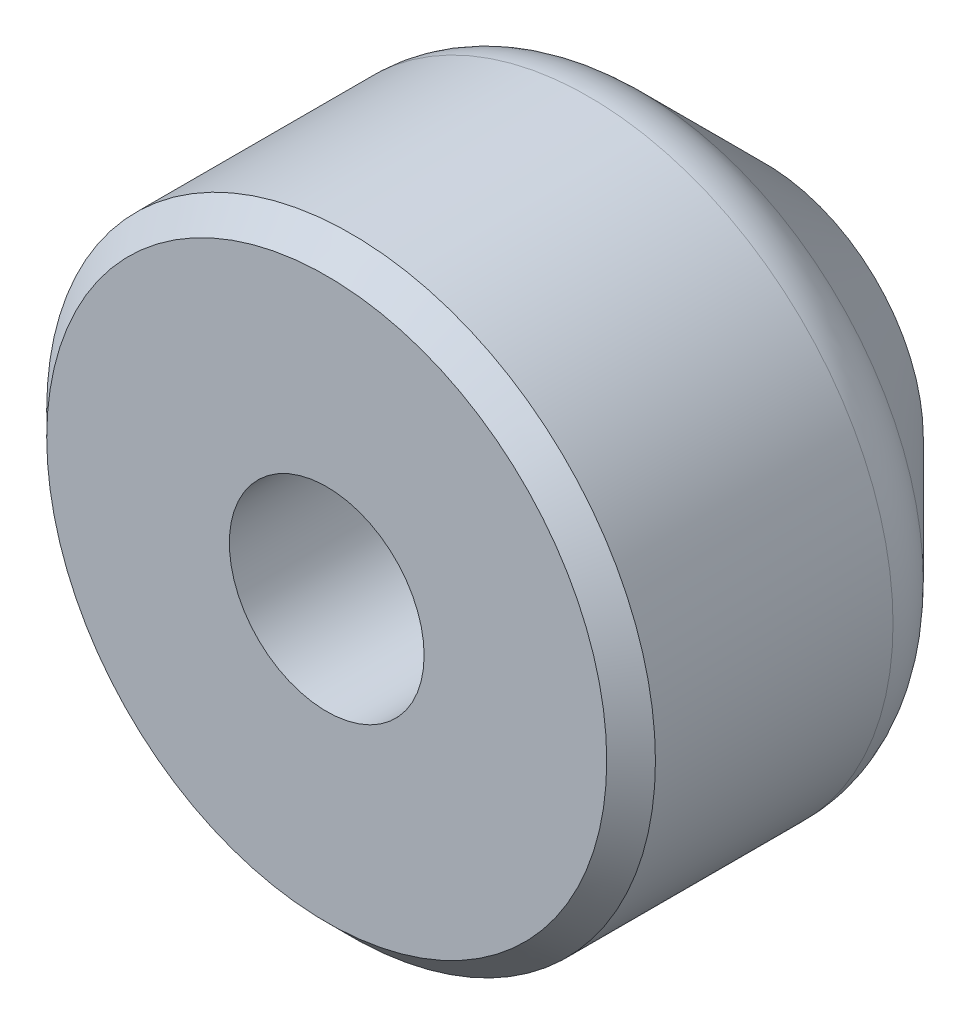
ISO-10303-21;
HEADER;
FILE_DESCRIPTION(('STEP AP214'),'2;1');
FILE_NAME('part.step','',(''),(''),'','','');
FILE_SCHEMA(('AUTOMOTIVE_DESIGN { 1 0 10303 214 1 1 1 1 }'));
ENDSEC;
DATA;
#1=APPLICATION_CONTEXT('core data for automotive mechanical design processes');
#2=APPLICATION_PROTOCOL_DEFINITION('international standard','automotive_design',2000,#1);
#3=PRODUCT_CONTEXT('',#1,'mechanical');
#4=PRODUCT('Part','Part','',(#3));
#5=PRODUCT_RELATED_PRODUCT_CATEGORY('part','',(#4));
#6=PRODUCT_DEFINITION_FORMATION('','',#4);
#7=PRODUCT_DEFINITION_CONTEXT('part definition',#1,'design');
#8=PRODUCT_DEFINITION('design','',#6,#7);
#9=PRODUCT_DEFINITION_SHAPE('','',#8);
#10=(LENGTH_UNIT() NAMED_UNIT(*) SI_UNIT(.MILLI.,.METRE.));
#11=(NAMED_UNIT(*) PLANE_ANGLE_UNIT() SI_UNIT($,.RADIAN.));
#12=(NAMED_UNIT(*) SI_UNIT($,.STERADIAN.) SOLID_ANGLE_UNIT());
#13=UNCERTAINTY_MEASURE_WITH_UNIT(LENGTH_MEASURE(1.E-05),#10,'distance_accuracy_value','');
#14=(GEOMETRIC_REPRESENTATION_CONTEXT(3) GLOBAL_UNCERTAINTY_ASSIGNED_CONTEXT((#13)) GLOBAL_UNIT_ASSIGNED_CONTEXT((#10,
#11,#12)) REPRESENTATION_CONTEXT('',''));
#15=CARTESIAN_POINT('',(0.,0.,0.));
#16=DIRECTION('',(0.,0.,1.));
#17=DIRECTION('',(1.,0.,0.));
#18=AXIS2_PLACEMENT_3D('',#15,#16,#17);
#19=CARTESIAN_POINT('',(0.,-4.,18.));
#20=DIRECTION('',(0.,0.,1.));
#21=DIRECTION('',(1.,0.,0.));
#22=AXIS2_PLACEMENT_3D('',#19,#20,#21);
#23=PLANE('',#22);
#24=CARTESIAN_POINT('',(0.,0.,18.));
#25=DIRECTION('',(0.,0.,1.));
#26=DIRECTION('',(1.,0.,0.));
#27=AXIS2_PLACEMENT_3D('',#24,#25,#26);
#28=CIRCLE('',#27,11.5);
#29=CARTESIAN_POINT('',(11.5,0.,18.));
#30=VERTEX_POINT('',#29);
#31=EDGE_CURVE('E8',#30,#30,#28,.T.);
#32=ORIENTED_EDGE('',*,*,#31,.T.);
#33=EDGE_LOOP('',(#32));
#34=FACE_BOUND('',#33,.T.);
#35=CARTESIAN_POINT('',(0.,0.,18.));
#36=DIRECTION('',(0.,0.,1.));
#37=DIRECTION('',(1.,0.,0.));
#38=AXIS2_PLACEMENT_3D('',#35,#36,#37);
#39=CIRCLE('',#38,4.);
#40=CARTESIAN_POINT('',(4.,0.,18.));
#41=VERTEX_POINT('',#40);
#42=EDGE_CURVE('E37',#41,#41,#39,.T.);
#43=ORIENTED_EDGE('',*,*,#42,.F.);
#44=EDGE_LOOP('',(#43));
#45=FACE_BOUND('',#44,.T.);
#46=ADVANCED_FACE('F12',(#34,#45),#23,.T.);
#47=CARTESIAN_POINT('',(0.,0.,17.));
#48=DIRECTION('',(0.,0.,-1.));
#49=DIRECTION('',(-1.,0.,0.));
#50=AXIS2_PLACEMENT_3D('',#47,#48,#49);
#51=CONICAL_SURFACE('',#50,12.5,0.785398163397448);
#52=ORIENTED_EDGE('',*,*,#31,.F.);
#53=EDGE_LOOP('',(#52));
#54=FACE_BOUND('',#53,.T.);
#55=CARTESIAN_POINT('',(0.,0.,17.));
#56=DIRECTION('',(0.,0.,1.));
#57=DIRECTION('',(1.,0.,0.));
#58=AXIS2_PLACEMENT_3D('',#55,#56,#57);
#59=CIRCLE('',#58,12.5);
#60=CARTESIAN_POINT('',(12.5,0.,17.));
#61=VERTEX_POINT('',#60);
#62=EDGE_CURVE('E18',#61,#61,#59,.T.);
#63=ORIENTED_EDGE('',*,*,#62,.T.);
#64=EDGE_LOOP('',(#63));
#65=FACE_BOUND('',#64,.T.);
#66=ADVANCED_FACE('F44',(#54,#65),#51,.T.);
#67=CARTESIAN_POINT('',(0.,0.,24.2022085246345));
#68=DIRECTION('',(0.,0.,1.));
#69=DIRECTION('',(1.,0.,0.));
#70=AXIS2_PLACEMENT_3D('',#67,#68,#69);
#71=CYLINDRICAL_SURFACE('',#70,12.5);
#72=CARTESIAN_POINT('',(0.,0.,7.24264068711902));
#73=DIRECTION('',(0.,0.,1.));
#74=DIRECTION('',(1.,0.,0.));
#75=AXIS2_PLACEMENT_3D('',#72,#73,#74);
#76=CIRCLE('',#75,12.5);
#77=CARTESIAN_POINT('',(12.5,0.,7.24264068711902));
#78=VERTEX_POINT('',#77);
#79=EDGE_CURVE('E22',#78,#78,#76,.T.);
#80=ORIENTED_EDGE('',*,*,#79,.T.);
#81=EDGE_LOOP('',(#80));
#82=FACE_BOUND('',#81,.T.);
#83=ORIENTED_EDGE('',*,*,#62,.F.);
#84=EDGE_LOOP('',(#83));
#85=FACE_BOUND('',#84,.T.);
#86=ADVANCED_FACE('F50',(#82,#85),#71,.T.);
#87=CARTESIAN_POINT('',(0.,0.,7.24264068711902));
#88=DIRECTION('',(0.,0.,1.));
#89=DIRECTION('',(1.,0.,0.));
#90=AXIS2_PLACEMENT_3D('',#87,#88,#89);
#91=TOROIDAL_SURFACE('',#90,9.5,3.);
#92=CARTESIAN_POINT('',(0.,0.,5.1213203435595));
#93=DIRECTION('',(0.,0.,1.));
#94=DIRECTION('',(1.,0.,0.));
#95=AXIS2_PLACEMENT_3D('',#92,#93,#94);
#96=CIRCLE('',#95,11.6213203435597);
#97=CARTESIAN_POINT('',(11.6213203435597,0.,5.1213203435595));
#98=VERTEX_POINT('',#97);
#99=EDGE_CURVE('E26',#98,#98,#96,.T.);
#100=ORIENTED_EDGE('',*,*,#99,.T.);
#101=EDGE_LOOP('',(#100));
#102=FACE_BOUND('',#101,.T.);
#103=ORIENTED_EDGE('',*,*,#79,.F.);
#104=EDGE_LOOP('',(#103));
#105=FACE_BOUND('',#104,.T.);
#106=ADVANCED_FACE('F56',(#102,#105),#91,.T.);
#107=CARTESIAN_POINT('',(0.,0.,5.1213203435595));
#108=DIRECTION('',(0.,0.,1.));
#109=DIRECTION('',(1.,0.,0.));
#110=AXIS2_PLACEMENT_3D('',#107,#108,#109);
#111=CONICAL_SURFACE('',#110,11.6213203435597,0.785398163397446);
#112=CARTESIAN_POINT('',(0.,0.,0.));
#113=DIRECTION('',(0.,0.,1.));
#114=DIRECTION('',(1.,0.,0.));
#115=AXIS2_PLACEMENT_3D('',#112,#113,#114);
#116=CIRCLE('',#115,6.5);
#117=CARTESIAN_POINT('',(6.5,0.,0.));
#118=VERTEX_POINT('',#117);
#119=EDGE_CURVE('E31',#118,#118,#116,.T.);
#120=ORIENTED_EDGE('',*,*,#119,.T.);
#121=EDGE_LOOP('',(#120));
#122=FACE_BOUND('',#121,.T.);
#123=ORIENTED_EDGE('',*,*,#99,.F.);
#124=EDGE_LOOP('',(#123));
#125=FACE_BOUND('',#124,.T.);
#126=ADVANCED_FACE('F62',(#122,#125),#111,.T.);
#127=CARTESIAN_POINT('',(0.,-6.5,0.));
#128=DIRECTION('',(0.,0.,-1.));
#129=DIRECTION('',(-1.,0.,0.));
#130=AXIS2_PLACEMENT_3D('',#127,#128,#129);
#131=PLANE('',#130);
#132=CARTESIAN_POINT('',(0.,0.,0.));
#133=DIRECTION('',(0.,0.,1.));
#134=DIRECTION('',(1.,0.,0.));
#135=AXIS2_PLACEMENT_3D('',#132,#133,#134);
#136=CIRCLE('',#135,4.);
#137=CARTESIAN_POINT('',(4.,0.,0.));
#138=VERTEX_POINT('',#137);
#139=EDGE_CURVE('E34',#138,#138,#136,.T.);
#140=ORIENTED_EDGE('',*,*,#139,.T.);
#141=EDGE_LOOP('',(#140));
#142=FACE_BOUND('',#141,.T.);
#143=ORIENTED_EDGE('',*,*,#119,.F.);
#144=EDGE_LOOP('',(#143));
#145=FACE_BOUND('',#144,.T.);
#146=ADVANCED_FACE('F66',(#142,#145),#131,.T.);
#147=CARTESIAN_POINT('',(0.,0.,24.2022085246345));
#148=DIRECTION('',(0.,0.,1.));
#149=DIRECTION('',(1.,0.,0.));
#150=AXIS2_PLACEMENT_3D('',#147,#148,#149);
#151=CYLINDRICAL_SURFACE('',#150,4.);
#152=ORIENTED_EDGE('',*,*,#139,.F.);
#153=EDGE_LOOP('',(#152));
#154=FACE_BOUND('',#153,.T.);
#155=ORIENTED_EDGE('',*,*,#42,.T.);
#156=EDGE_LOOP('',(#155));
#157=FACE_BOUND('',#156,.T.);
#158=ADVANCED_FACE('F41',(#154,#157),#151,.F.);
#159=CLOSED_SHELL('',(#46,#66,#86,#106,#126,#146,#158));
#160=MANIFOLD_SOLID_BREP('B1',#159);
#161=ADVANCED_BREP_SHAPE_REPRESENTATION('',(#18,#160),#14);
#162=SHAPE_DEFINITION_REPRESENTATION(#9,#161);
ENDSEC;
END-ISO-10303-21;
